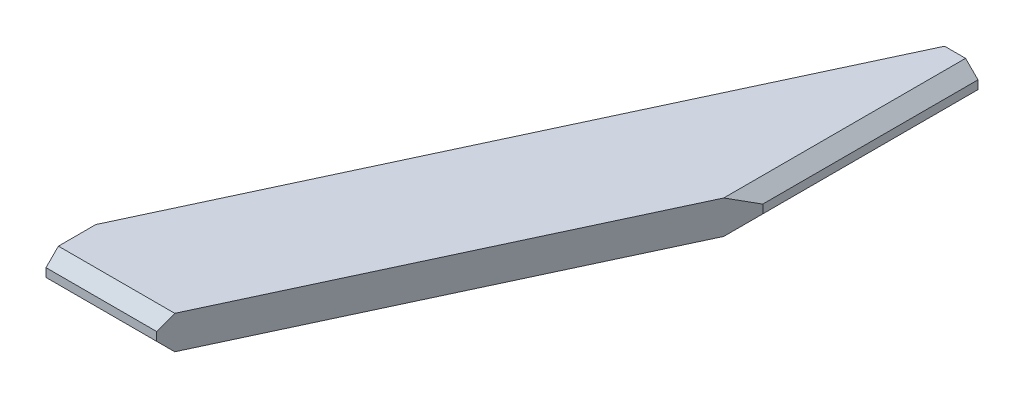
ISO-10303-21;
HEADER;
FILE_DESCRIPTION(('STEP AP214'),'2;1');
FILE_NAME('part.step','',(''),(''),'','','');
FILE_SCHEMA(('AUTOMOTIVE_DESIGN { 1 0 10303 214 1 1 1 1 }'));
ENDSEC;
DATA;
#1=APPLICATION_CONTEXT('core data for automotive mechanical design processes');
#2=APPLICATION_PROTOCOL_DEFINITION('international standard','automotive_design',2000,#1);
#3=PRODUCT_CONTEXT('',#1,'mechanical');
#4=PRODUCT('Part','Part','',(#3));
#5=PRODUCT_RELATED_PRODUCT_CATEGORY('part','',(#4));
#6=PRODUCT_DEFINITION_FORMATION('','',#4);
#7=PRODUCT_DEFINITION_CONTEXT('part definition',#1,'design');
#8=PRODUCT_DEFINITION('design','',#6,#7);
#9=PRODUCT_DEFINITION_SHAPE('','',#8);
#10=(LENGTH_UNIT() NAMED_UNIT(*) SI_UNIT(.MILLI.,.METRE.));
#11=(NAMED_UNIT(*) PLANE_ANGLE_UNIT() SI_UNIT($,.RADIAN.));
#12=(NAMED_UNIT(*) SI_UNIT($,.STERADIAN.) SOLID_ANGLE_UNIT());
#13=UNCERTAINTY_MEASURE_WITH_UNIT(LENGTH_MEASURE(1.E-05),#10,'distance_accuracy_value','');
#14=(GEOMETRIC_REPRESENTATION_CONTEXT(3) GLOBAL_UNCERTAINTY_ASSIGNED_CONTEXT((#13)) GLOBAL_UNIT_ASSIGNED_CONTEXT((#10,
#11,#12)) REPRESENTATION_CONTEXT('',''));
#15=CARTESIAN_POINT('',(0.,0.,0.));
#16=DIRECTION('',(0.,0.,1.));
#17=DIRECTION('',(1.,0.,0.));
#18=AXIS2_PLACEMENT_3D('',#15,#16,#17);
#19=CARTESIAN_POINT('',(-179.081547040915,17.4625,285.920774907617));
#20=DIRECTION('',(1.,0.,0.));
#21=DIRECTION('',(0.,0.,-1.));
#22=AXIS2_PLACEMENT_3D('',#19,#20,#21);
#23=PLANE('',#22);
#24=DIRECTION('',(0.,0.,1.));
#25=VECTOR('',#24,1.);
#26=CARTESIAN_POINT('',(-179.081547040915,-17.4625,285.920774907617));
#27=LINE('',#26,#25);
#28=CARTESIAN_POINT('',(-179.081547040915,-17.4625,233.787816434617));
#29=VERTEX_POINT('',#28);
#30=CARTESIAN_POINT('',(-179.081547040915,-17.4625,272.920774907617));
#31=VERTEX_POINT('',#30);
#32=EDGE_CURVE('E156',#29,#31,#27,.T.);
#33=ORIENTED_EDGE('',*,*,#32,.T.);
#34=DIRECTION('',(0.,0.707106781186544,0.707106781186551));
#35=VECTOR('',#34,1.);
#36=CARTESIAN_POINT('',(-179.081547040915,-4.46249999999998,285.920774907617));
#37=LINE('',#36,#35);
#38=CARTESIAN_POINT('',(-179.081547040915,-4.46249999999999,285.920774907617));
#39=VERTEX_POINT('',#38);
#40=EDGE_CURVE('E11',#31,#39,#37,.T.);
#41=ORIENTED_EDGE('',*,*,#40,.T.);
#42=DIRECTION('',(0.,-1.,0.));
#43=VECTOR('',#42,1.);
#44=CARTESIAN_POINT('',(-179.081547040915,17.4625,285.920774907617));
#45=LINE('',#44,#43);
#46=CARTESIAN_POINT('',(-179.081547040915,4.46249999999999,285.920774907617));
#47=VERTEX_POINT('',#46);
#48=EDGE_CURVE('E182',#47,#39,#45,.T.);
#49=ORIENTED_EDGE('',*,*,#48,.F.);
#50=DIRECTION('',(0.,-0.70710678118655,0.707106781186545));
#51=VECTOR('',#50,1.);
#52=CARTESIAN_POINT('',(-179.081547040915,17.4625,272.920774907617));
#53=LINE('',#52,#51);
#54=CARTESIAN_POINT('',(-179.081547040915,17.4625,272.920774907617));
#55=VERTEX_POINT('',#54);
#56=EDGE_CURVE('E57',#47,#55,#53,.F.);
#57=ORIENTED_EDGE('',*,*,#56,.T.);
#58=DIRECTION('',(0.,0.,1.));
#59=VECTOR('',#58,1.);
#60=CARTESIAN_POINT('',(-179.081547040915,17.4625,285.920774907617));
#61=LINE('',#60,#59);
#62=CARTESIAN_POINT('',(-179.081547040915,17.4625,233.787816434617));
#63=VERTEX_POINT('',#62);
#64=EDGE_CURVE('E167',#63,#55,#61,.T.);
#65=ORIENTED_EDGE('',*,*,#64,.F.);
#66=DIRECTION('',(0.,-1.,0.));
#67=VECTOR('',#66,1.);
#68=CARTESIAN_POINT('',(-179.081547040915,17.4625,233.787816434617));
#69=LINE('',#68,#67);
#70=EDGE_CURVE('E149',#63,#29,#69,.T.);
#71=ORIENTED_EDGE('',*,*,#70,.T.);
#72=EDGE_LOOP('',(#33,#41,#49,#57,#65,#71));
#73=FACE_BOUND('',#72,.T.);
#74=ADVANCED_FACE('F46',(#73),#23,.F.);
#75=CARTESIAN_POINT('',(-63.2625491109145,17.4625,285.920774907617));
#76=DIRECTION('',(0.,0.,-1.));
#77=DIRECTION('',(-1.,0.,0.));
#78=AXIS2_PLACEMENT_3D('',#75,#76,#77);
#79=PLANE('',#78);
#80=ORIENTED_EDGE('',*,*,#48,.T.);
#81=DIRECTION('',(1.,0.,0.));
#82=VECTOR('',#81,1.);
#83=CARTESIAN_POINT('',(-63.2625491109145,-4.46249999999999,285.920774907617));
#84=LINE('',#83,#82);
#85=CARTESIAN_POINT('',(-63.2625491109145,-4.46249999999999,285.920774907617));
#86=VERTEX_POINT('',#85);
#87=EDGE_CURVE('E223',#39,#86,#84,.T.);
#88=ORIENTED_EDGE('',*,*,#87,.T.);
#89=DIRECTION('',(0.,-1.,0.));
#90=VECTOR('',#89,1.);
#91=CARTESIAN_POINT('',(-63.2625491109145,17.4625,285.920774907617));
#92=LINE('',#91,#90);
#93=CARTESIAN_POINT('',(-63.2625491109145,4.46249999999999,285.920774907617));
#94=VERTEX_POINT('',#93);
#95=EDGE_CURVE('E177',#94,#86,#92,.T.);
#96=ORIENTED_EDGE('',*,*,#95,.F.);
#97=DIRECTION('',(-1.,0.,0.));
#98=VECTOR('',#97,1.);
#99=CARTESIAN_POINT('',(-63.2625491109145,4.46249999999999,285.920774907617));
#100=LINE('',#99,#98);
#101=EDGE_CURVE('E70',#94,#47,#100,.T.);
#102=ORIENTED_EDGE('',*,*,#101,.T.);
#103=EDGE_LOOP('',(#80,#88,#96,#102));
#104=FACE_BOUND('',#103,.T.);
#105=ADVANCED_FACE('F238',(#104),#79,.F.);
#106=CARTESIAN_POINT('',(-63.2625491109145,17.4625,285.920774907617));
#107=DIRECTION('',(-0.906307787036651,0.,-0.422618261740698));
#108=DIRECTION('',(-0.422618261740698,0.,0.906307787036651));
#109=AXIS2_PLACEMENT_3D('',#106,#107,#108);
#110=PLANE('',#109);
#111=DIRECTION('',(0.,-1.,0.));
#112=VECTOR('',#111,1.);
#113=CARTESIAN_POINT('',(138.672048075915,17.4625,-147.129366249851));
#114=LINE('',#113,#112);
#115=CARTESIAN_POINT('',(138.672048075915,4.46249999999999,-147.129366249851));
#116=VERTEX_POINT('',#115);
#117=CARTESIAN_POINT('',(138.672048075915,-4.46249999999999,-147.129366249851));
#118=VERTEX_POINT('',#117);
#119=EDGE_CURVE('E174',#116,#118,#114,.T.);
#120=ORIENTED_EDGE('',*,*,#119,.F.);
#121=DIRECTION('',(0.389281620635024,-0.389281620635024,-0.834817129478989));
#122=VECTOR('',#121,1.);
#123=CARTESIAN_POINT('',(86.918054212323,56.2164938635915,-36.1425682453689));
#124=LINE('',#123,#122);
#125=CARTESIAN_POINT('',(125.672048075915,17.4625,-119.250776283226));
#126=VERTEX_POINT('',#125);
#127=EDGE_CURVE('E211',#116,#126,#124,.F.);
#128=ORIENTED_EDGE('',*,*,#127,.T.);
#129=DIRECTION('',(0.422618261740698,0.,-0.906307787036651));
#130=VECTOR('',#129,1.);
#131=CARTESIAN_POINT('',(-63.2625491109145,17.4625,285.920774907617));
#132=LINE('',#131,#130);
#133=CARTESIAN_POINT('',(-57.2005495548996,17.4625,272.920774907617));
#134=VERTEX_POINT('',#133);
#135=EDGE_CURVE('E139',#134,#126,#132,.T.);
#136=ORIENTED_EDGE('',*,*,#135,.F.);
#137=DIRECTION('',(0.313145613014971,0.671542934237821,-0.671542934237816));
#138=VECTOR('',#137,1.);
#139=CARTESIAN_POINT('',(-51.5914536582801,29.4912449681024,260.892029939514));
#140=LINE('',#139,#138);
#141=EDGE_CURVE('E203',#134,#94,#140,.F.);
#142=ORIENTED_EDGE('',*,*,#141,.T.);
#143=ORIENTED_EDGE('',*,*,#95,.T.);
#144=DIRECTION('',(0.313145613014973,-0.671542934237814,-0.671542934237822));
#145=VECTOR('',#144,1.);
#146=CARTESIAN_POINT('',(-63.2625491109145,-4.46249999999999,285.920774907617));
#147=LINE('',#146,#145);
#148=CARTESIAN_POINT('',(-57.2005495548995,-17.4625,272.920774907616));
#149=VERTEX_POINT('',#148);
#150=EDGE_CURVE('E206',#86,#149,#147,.T.);
#151=ORIENTED_EDGE('',*,*,#150,.T.);
#152=DIRECTION('',(0.422618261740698,0.,-0.906307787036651));
#153=VECTOR('',#152,1.);
#154=CARTESIAN_POINT('',(-63.2625491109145,-17.4625,285.920774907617));
#155=LINE('',#154,#153);
#156=CARTESIAN_POINT('',(125.672048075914,-17.4625,-119.250776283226));
#157=VERTEX_POINT('',#156);
#158=EDGE_CURVE('E162',#149,#157,#155,.T.);
#159=ORIENTED_EDGE('',*,*,#158,.T.);
#160=DIRECTION('',(0.389281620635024,0.389281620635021,-0.83481712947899));
#161=VECTOR('',#160,1.);
#162=CARTESIAN_POINT('',(211.938509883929,68.8039618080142,-304.249800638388));
#163=LINE('',#162,#161);
#164=EDGE_CURVE('E212',#157,#118,#163,.T.);
#165=ORIENTED_EDGE('',*,*,#164,.T.);
#166=EDGE_LOOP('',(#120,#128,#136,#142,#143,#151,#159,#165));
#167=FACE_BOUND('',#166,.T.);
#168=ADVANCED_FACE('F240',(#167),#110,.F.);
#169=CARTESIAN_POINT('',(138.672048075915,17.4625,-372.579225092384));
#170=DIRECTION('',(-1.,0.,0.));
#171=DIRECTION('',(0.,0.,1.));
#172=AXIS2_PLACEMENT_3D('',#169,#170,#171);
#173=PLANE('',#172);
#174=DIRECTION('',(0.,-1.,0.));
#175=VECTOR('',#174,1.);
#176=CARTESIAN_POINT('',(138.672048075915,17.4625,-372.579225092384));
#177=LINE('',#176,#175);
#178=CARTESIAN_POINT('',(138.672048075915,4.46249999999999,-372.579225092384));
#179=VERTEX_POINT('',#178);
#180=CARTESIAN_POINT('',(138.672048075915,-4.46249999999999,-372.579225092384));
#181=VERTEX_POINT('',#180);
#182=EDGE_CURVE('E150',#179,#181,#177,.T.);
#183=ORIENTED_EDGE('',*,*,#182,.F.);
#184=DIRECTION('',(0.,0.,1.));
#185=VECTOR('',#184,1.);
#186=CARTESIAN_POINT('',(138.672048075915,4.46249999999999,-372.579225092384));
#187=LINE('',#186,#185);
#188=EDGE_CURVE('E204',#179,#116,#187,.T.);
#189=ORIENTED_EDGE('',*,*,#188,.T.);
#190=ORIENTED_EDGE('',*,*,#119,.T.);
#191=DIRECTION('',(0.,0.,-1.));
#192=VECTOR('',#191,1.);
#193=CARTESIAN_POINT('',(138.672048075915,-4.46249999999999,-372.579225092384));
#194=LINE('',#193,#192);
#195=EDGE_CURVE('E200',#118,#181,#194,.T.);
#196=ORIENTED_EDGE('',*,*,#195,.T.);
#197=EDGE_LOOP('',(#183,#189,#190,#196));
#198=FACE_BOUND('',#197,.T.);
#199=ADVANCED_FACE('F253',(#198),#173,.F.);
#200=CARTESIAN_POINT('',(103.672048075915,17.4625,-372.579225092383));
#201=DIRECTION('',(0.,0.,1.));
#202=DIRECTION('',(1.,0.,0.));
#203=AXIS2_PLACEMENT_3D('',#200,#201,#202);
#204=PLANE('',#203);
#205=DIRECTION('',(-1.,0.,0.));
#206=VECTOR('',#205,1.);
#207=CARTESIAN_POINT('',(103.672048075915,17.4625,-372.579225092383));
#208=LINE('',#207,#206);
#209=CARTESIAN_POINT('',(125.672048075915,17.4625,-372.579225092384));
#210=VERTEX_POINT('',#209);
#211=CARTESIAN_POINT('',(103.672048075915,17.4625,-372.579225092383));
#212=VERTEX_POINT('',#211);
#213=EDGE_CURVE('E123',#210,#212,#208,.T.);
#214=ORIENTED_EDGE('',*,*,#213,.F.);
#215=DIRECTION('',(-0.707106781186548,0.707106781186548,0.));
#216=VECTOR('',#215,1.);
#217=CARTESIAN_POINT('',(125.672048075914,17.4625000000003,-372.579225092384));
#218=LINE('',#217,#216);
#219=EDGE_CURVE('E193',#210,#179,#218,.F.);
#220=ORIENTED_EDGE('',*,*,#219,.T.);
#221=ORIENTED_EDGE('',*,*,#182,.T.);
#222=DIRECTION('',(-0.707106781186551,-0.707106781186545,0.));
#223=VECTOR('',#222,1.);
#224=CARTESIAN_POINT('',(138.672048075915,-4.46249999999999,-372.579225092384));
#225=LINE('',#224,#223);
#226=CARTESIAN_POINT('',(125.672048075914,-17.4625,-372.579225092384));
#227=VERTEX_POINT('',#226);
#228=EDGE_CURVE('E195',#181,#227,#225,.T.);
#229=ORIENTED_EDGE('',*,*,#228,.T.);
#230=DIRECTION('',(-1.,0.,0.));
#231=VECTOR('',#230,1.);
#232=CARTESIAN_POINT('',(103.672048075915,-17.4625,-372.579225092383));
#233=LINE('',#232,#231);
#234=CARTESIAN_POINT('',(103.672048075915,-17.4625,-372.579225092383));
#235=VERTEX_POINT('',#234);
#236=EDGE_CURVE('E141',#227,#235,#233,.T.);
#237=ORIENTED_EDGE('',*,*,#236,.T.);
#238=DIRECTION('',(0.,-1.,0.));
#239=VECTOR('',#238,1.);
#240=CARTESIAN_POINT('',(103.672048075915,17.4625,-372.579225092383));
#241=LINE('',#240,#239);
#242=EDGE_CURVE('E138',#212,#235,#241,.T.);
#243=ORIENTED_EDGE('',*,*,#242,.F.);
#244=EDGE_LOOP('',(#214,#220,#221,#229,#237,#243));
#245=FACE_BOUND('',#244,.T.);
#246=ADVANCED_FACE('F142',(#245),#204,.F.);
#247=CARTESIAN_POINT('',(-179.081547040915,17.4625,233.787816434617));
#248=DIRECTION('',(0.906307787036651,0.,0.422618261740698));
#249=DIRECTION('',(0.422618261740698,0.,-0.906307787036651));
#250=AXIS2_PLACEMENT_3D('',#247,#248,#249);
#251=PLANE('',#250);
#252=DIRECTION('',(-0.422618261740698,0.,0.906307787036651));
#253=VECTOR('',#252,1.);
#254=CARTESIAN_POINT('',(-179.081547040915,-17.4625,233.787816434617));
#255=LINE('',#254,#253);
#256=EDGE_CURVE('E166',#235,#29,#255,.T.);
#257=ORIENTED_EDGE('',*,*,#256,.T.);
#258=ORIENTED_EDGE('',*,*,#70,.F.);
#259=DIRECTION('',(-0.422618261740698,0.,0.906307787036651));
#260=VECTOR('',#259,1.);
#261=CARTESIAN_POINT('',(-179.081547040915,17.4625,233.787816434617));
#262=LINE('',#261,#260);
#263=EDGE_CURVE('E132',#212,#63,#262,.T.);
#264=ORIENTED_EDGE('',*,*,#263,.F.);
#265=ORIENTED_EDGE('',*,*,#242,.T.);
#266=EDGE_LOOP('',(#257,#258,#264,#265));
#267=FACE_BOUND('',#266,.T.);
#268=ADVANCED_FACE('F148',(#267),#251,.F.);
#269=CARTESIAN_POINT('',(0.,17.4625,0.));
#270=DIRECTION('',(0.,-1.,0.));
#271=DIRECTION('',(0.,0.,-1.));
#272=AXIS2_PLACEMENT_3D('',#269,#270,#271);
#273=PLANE('',#272);
#274=ORIENTED_EDGE('',*,*,#135,.T.);
#275=DIRECTION('',(0.,0.,-1.));
#276=VECTOR('',#275,1.);
#277=CARTESIAN_POINT('',(125.672048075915,17.4625,0.));
#278=LINE('',#277,#276);
#279=EDGE_CURVE('E131',#126,#210,#278,.T.);
#280=ORIENTED_EDGE('',*,*,#279,.T.);
#281=ORIENTED_EDGE('',*,*,#213,.T.);
#282=ORIENTED_EDGE('',*,*,#263,.T.);
#283=ORIENTED_EDGE('',*,*,#64,.T.);
#284=DIRECTION('',(1.,0.,0.));
#285=VECTOR('',#284,1.);
#286=CARTESIAN_POINT('',(1.30808819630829E-13,17.4625,272.920774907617));
#287=LINE('',#286,#285);
#288=EDGE_CURVE('E187',#55,#134,#287,.T.);
#289=ORIENTED_EDGE('',*,*,#288,.T.);
#290=EDGE_LOOP('',(#274,#280,#281,#282,#283,#289));
#291=FACE_BOUND('',#290,.T.);
#292=ADVANCED_FACE('F129',(#291),#273,.F.);
#293=CARTESIAN_POINT('',(0.,-17.4625,0.));
#294=DIRECTION('',(0.,-1.,0.));
#295=DIRECTION('',(0.,0.,-1.));
#296=AXIS2_PLACEMENT_3D('',#293,#294,#295);
#297=PLANE('',#296);
#298=ORIENTED_EDGE('',*,*,#236,.F.);
#299=DIRECTION('',(0.,0.,1.));
#300=VECTOR('',#299,1.);
#301=CARTESIAN_POINT('',(125.672048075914,-17.4625,-147.129366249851));
#302=LINE('',#301,#300);
#303=EDGE_CURVE('E218',#227,#157,#302,.T.);
#304=ORIENTED_EDGE('',*,*,#303,.T.);
#305=ORIENTED_EDGE('',*,*,#158,.F.);
#306=DIRECTION('',(-1.,0.,0.));
#307=VECTOR('',#306,1.);
#308=CARTESIAN_POINT('',(-179.081547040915,-17.4625,272.920774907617));
#309=LINE('',#308,#307);
#310=EDGE_CURVE('E219',#149,#31,#309,.T.);
#311=ORIENTED_EDGE('',*,*,#310,.T.);
#312=ORIENTED_EDGE('',*,*,#32,.F.);
#313=ORIENTED_EDGE('',*,*,#256,.F.);
#314=EDGE_LOOP('',(#298,#304,#305,#311,#312,#313));
#315=FACE_BOUND('',#314,.T.);
#316=ADVANCED_FACE('F246',(#315),#297,.T.);
#317=CARTESIAN_POINT('',(125.672048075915,17.4625,0.));
#318=DIRECTION('',(-0.707106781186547,-0.707106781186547,0.));
#319=DIRECTION('',(0.,0.,-1.));
#320=AXIS2_PLACEMENT_3D('',#317,#318,#319);
#321=PLANE('',#320);
#322=ORIENTED_EDGE('',*,*,#127,.F.);
#323=ORIENTED_EDGE('',*,*,#188,.F.);
#324=ORIENTED_EDGE('',*,*,#219,.F.);
#325=ORIENTED_EDGE('',*,*,#279,.F.);
#326=EDGE_LOOP('',(#322,#323,#324,#325));
#327=FACE_BOUND('',#326,.T.);
#328=ADVANCED_FACE('F259',(#327),#321,.F.);
#329=CARTESIAN_POINT('',(138.672048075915,-4.46249999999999,-372.579225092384));
#330=DIRECTION('',(0.707106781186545,-0.707106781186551,0.));
#331=DIRECTION('',(0.,0.,1.));
#332=AXIS2_PLACEMENT_3D('',#329,#330,#331);
#333=PLANE('',#332);
#334=ORIENTED_EDGE('',*,*,#164,.F.);
#335=ORIENTED_EDGE('',*,*,#303,.F.);
#336=ORIENTED_EDGE('',*,*,#228,.F.);
#337=ORIENTED_EDGE('',*,*,#195,.F.);
#338=EDGE_LOOP('',(#334,#335,#336,#337));
#339=FACE_BOUND('',#338,.T.);
#340=ADVANCED_FACE('F249',(#339),#333,.T.);
#341=CARTESIAN_POINT('',(-63.2625491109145,-4.46249999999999,285.920774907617));
#342=DIRECTION('',(0.,-0.707106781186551,0.707106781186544));
#343=DIRECTION('',(-1.,0.,0.));
#344=AXIS2_PLACEMENT_3D('',#341,#342,#343);
#345=PLANE('',#344);
#346=ORIENTED_EDGE('',*,*,#40,.F.);
#347=ORIENTED_EDGE('',*,*,#310,.F.);
#348=ORIENTED_EDGE('',*,*,#150,.F.);
#349=ORIENTED_EDGE('',*,*,#87,.F.);
#350=EDGE_LOOP('',(#346,#347,#348,#349));
#351=FACE_BOUND('',#350,.T.);
#352=ADVANCED_FACE('F241',(#351),#345,.T.);
#353=CARTESIAN_POINT('',(1.30808819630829E-13,17.4625,272.920774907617));
#354=DIRECTION('',(0.,-0.707106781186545,-0.70710678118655));
#355=DIRECTION('',(1.,0.,0.));
#356=AXIS2_PLACEMENT_3D('',#353,#354,#355);
#357=PLANE('',#356);
#358=ORIENTED_EDGE('',*,*,#56,.F.);
#359=ORIENTED_EDGE('',*,*,#101,.F.);
#360=ORIENTED_EDGE('',*,*,#141,.F.);
#361=ORIENTED_EDGE('',*,*,#288,.F.);
#362=EDGE_LOOP('',(#358,#359,#360,#361));
#363=FACE_BOUND('',#362,.T.);
#364=ADVANCED_FACE('F47',(#363),#357,.F.);
#365=CLOSED_SHELL('',(#74,#105,#168,#199,#246,#268,#292,#316,#328,#340,#352,#364));
#366=MANIFOLD_SOLID_BREP('B2',#365);
#367=ADVANCED_BREP_SHAPE_REPRESENTATION('',(#18,#366),#14);
#368=SHAPE_DEFINITION_REPRESENTATION(#9,#367);
ENDSEC;
END-ISO-10303-21;
